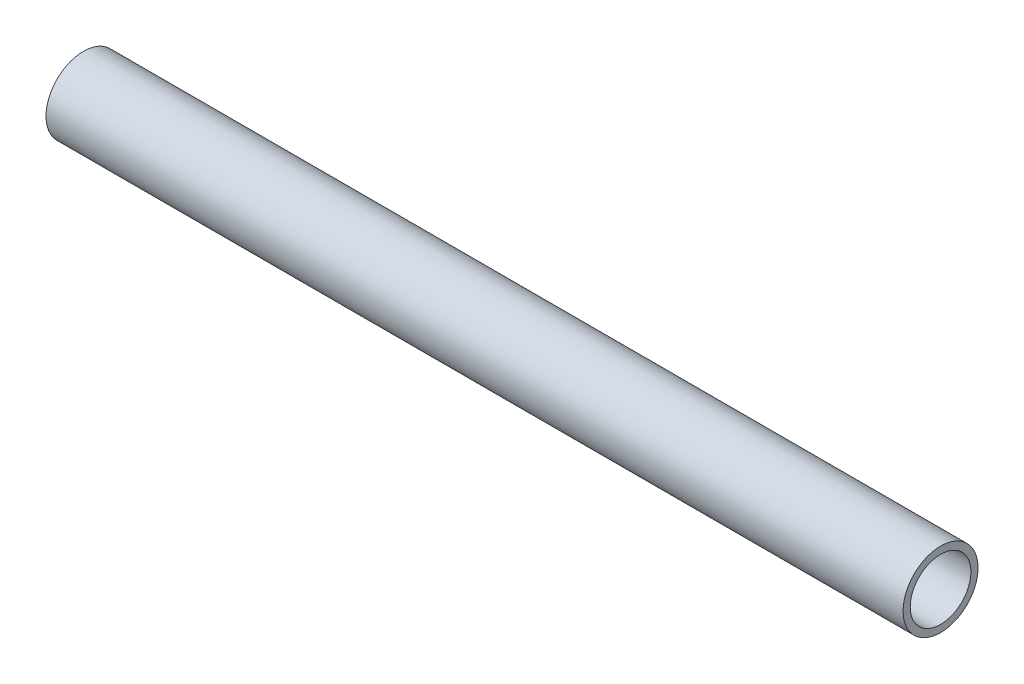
from build123d import *

# Parameters (mm, degrees)
ESQUISSE1_W = 240
ESQUISSE1_H = 2


with BuildPart() as part:
    # Esquisse1 → R_volution1 (revolve)
    with BuildSketch(Plane.XY, mode=Mode.PRIVATE) as r_volution1_sk:
        with Locations((0, 9.5)):
            Rectangle(ESQUISSE1_W, ESQUISSE1_H)
    revolve(r_volution1_sk.sketch.rotate(Axis((-62.115848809, 0, 0), (1, 0, 0)), 90), axis=Axis((-62.115848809, 0, 0), (1, 0, 0)))


solid = part.part
